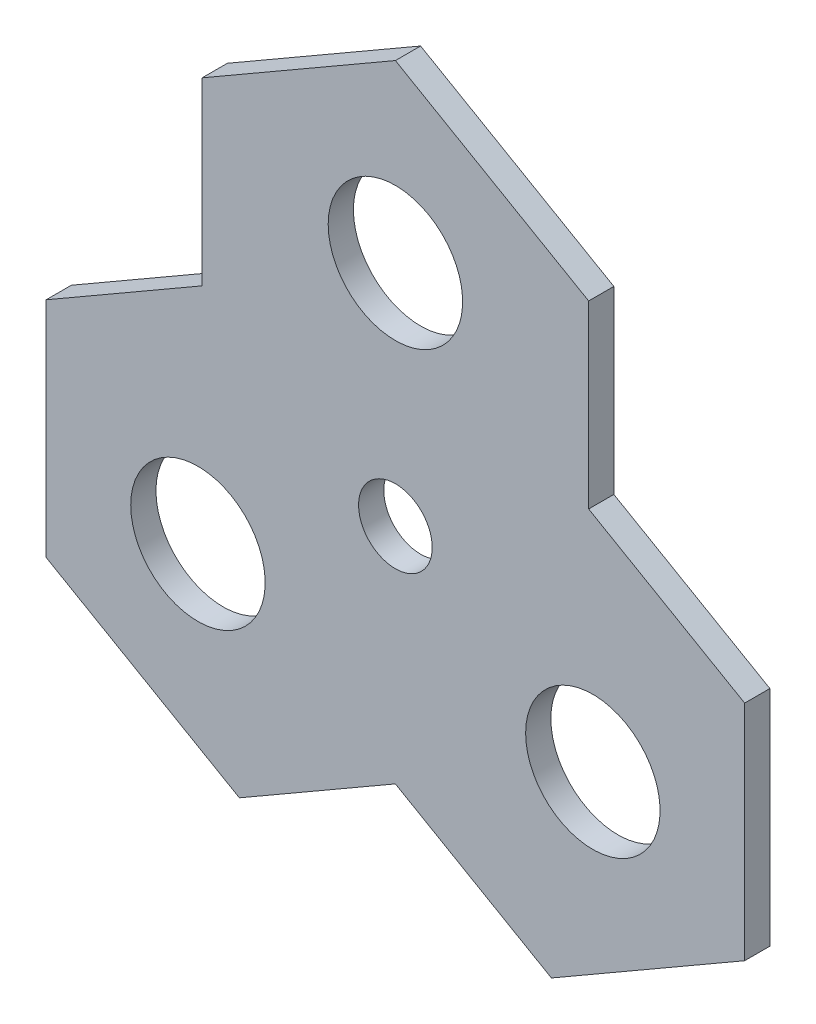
from build123d import *

# Parameters (mm, degrees)
SKETCH2_R           = 13.918931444
SKETCH2_R_2         = 25.4
BOSS_EXTRUDE1_DEPTH = 9.525


with BuildPart() as part:
    # Sketch2 → Boss-Extrude1 (new body)
    with BuildSketch(Plane.XY):
        Polygon((0, 152.4), (73.025, 110.238996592), (73.025, 42.161003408), (131.982271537, 8.122006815), (131.982271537, -76.2), (58.957271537, -118.361003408), (0, -84.322006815), (-58.957271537, -118.361003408), (-131.982271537, -76.2), (-131.982271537, 8.122006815), (-73.025, 42.161003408), (-73.025, 110.238996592), align=None)
        with Locations(Location((0, 0, 0), (0, 0, 180))):
            Circle(SKETCH2_R, mode=Mode.SUBTRACT)
        with Locations(Location((0, 86.15509392, 0), (0, 0, 180))):
            Circle(SKETCH2_R_2, mode=Mode.SUBTRACT)
        with Locations(Location((74.6125, -43.07754696, 0), (0, 0, 180))):
            Circle(SKETCH2_R_2, mode=Mode.SUBTRACT)
        with Locations(Location((-74.6125, -43.07754696, 0), (0, 0, 180))):
            Circle(SKETCH2_R_2, mode=Mode.SUBTRACT)
    extrude(amount=BOSS_EXTRUDE1_DEPTH)


solid = part.part
